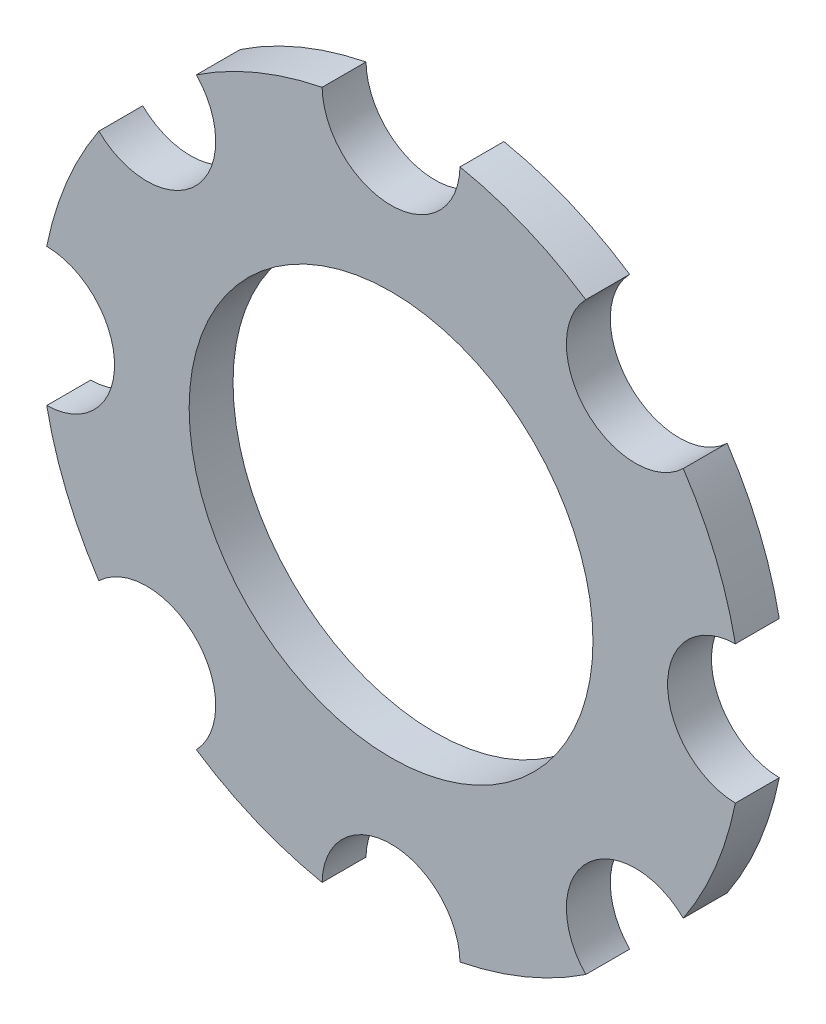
from build123d import *

# Parameters (mm, degrees)
SKETCH1_R          = 4
SKETCH1_R_2        = 2.3
BASE_EXTRUDE_DEPTH = 0.5
TYPEASLOT_DEPTH    = 10.383650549
TYPEAPATTERN_COUNT = 8


with BuildPart() as part:
    # Sketch1 → Base-Extrude (new body)
    with BuildSketch(Plane.XY):
        Circle(SKETCH1_R)
        Circle(SKETCH1_R_2, mode=Mode.SUBTRACT)
    extrude(amount=-BASE_EXTRUDE_DEPTH)

    # Sketch2 → TypeASlot (cut, through all)
    with BuildSketch(Plane(origin=(-3.136340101, -2.072523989, 0), x_dir=(1, 0, 0), z_dir=(0, 0, 1))):
        with BuildLine():
            Line((2.350942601, 16.007921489), (2.350942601, 6.007921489))
            ThreePointArc((2.350942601, 6.007921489), (3.136340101, 5.222523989), (3.921737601, 6.007921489))
            Line((3.921737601, 6.007921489), (3.921737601, 16.007921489))
            Line((3.921737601, 16.007921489), (2.350942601, 16.007921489))
        make_face()
    typeaslot = extrude(amount=-TYPEASLOT_DEPTH, mode=Mode.SUBTRACT)

    # TypeAPattern: TypeASlot ×8 about axis
    typeapattern_axis = Axis((0, 0, 0), (0, 0, 1))
    for i in range(1, TYPEAPATTERN_COUNT):
        add(typeaslot.rotate(typeapattern_axis, i * 360 / TYPEAPATTERN_COUNT), mode=Mode.SUBTRACT)


solid = part.part
